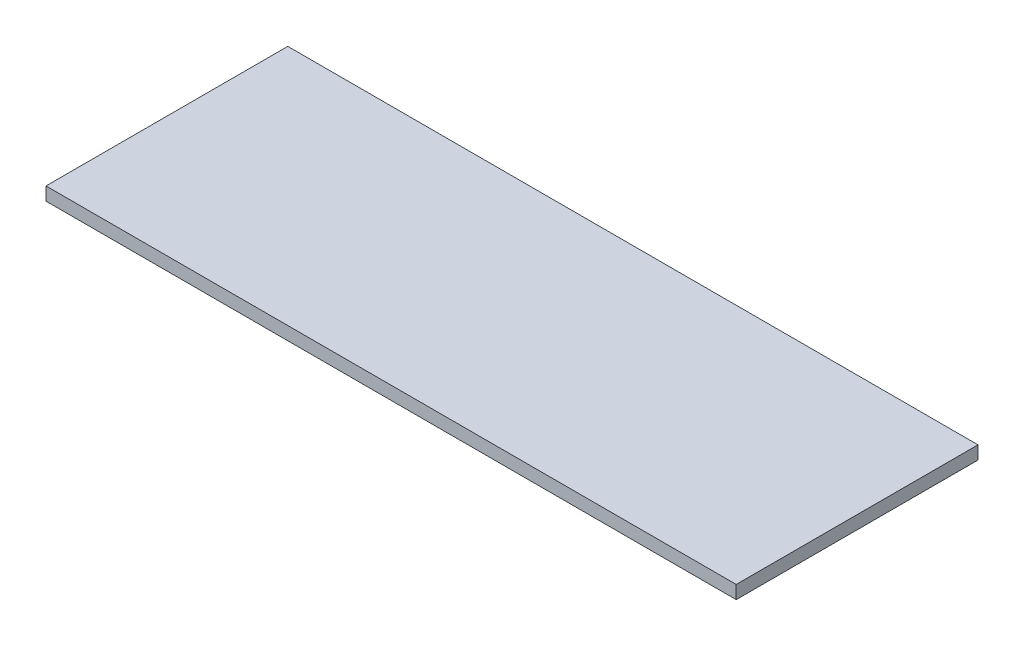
ISO-10303-21;
HEADER;
FILE_DESCRIPTION(('STEP AP214'),'2;1');
FILE_NAME('part.step','',(''),(''),'','','');
FILE_SCHEMA(('AUTOMOTIVE_DESIGN { 1 0 10303 214 1 1 1 1 }'));
ENDSEC;
DATA;
#1=APPLICATION_CONTEXT('core data for automotive mechanical design processes');
#2=APPLICATION_PROTOCOL_DEFINITION('international standard','automotive_design',2000,#1);
#3=PRODUCT_CONTEXT('',#1,'mechanical');
#4=PRODUCT('Part','Part','',(#3));
#5=PRODUCT_RELATED_PRODUCT_CATEGORY('part','',(#4));
#6=PRODUCT_DEFINITION_FORMATION('','',#4);
#7=PRODUCT_DEFINITION_CONTEXT('part definition',#1,'design');
#8=PRODUCT_DEFINITION('design','',#6,#7);
#9=PRODUCT_DEFINITION_SHAPE('','',#8);
#10=(LENGTH_UNIT() NAMED_UNIT(*) SI_UNIT(.MILLI.,.METRE.));
#11=(NAMED_UNIT(*) PLANE_ANGLE_UNIT() SI_UNIT($,.RADIAN.));
#12=(NAMED_UNIT(*) SI_UNIT($,.STERADIAN.) SOLID_ANGLE_UNIT());
#13=UNCERTAINTY_MEASURE_WITH_UNIT(LENGTH_MEASURE(1.E-05),#10,'distance_accuracy_value','');
#14=(GEOMETRIC_REPRESENTATION_CONTEXT(3) GLOBAL_UNCERTAINTY_ASSIGNED_CONTEXT((#13)) GLOBAL_UNIT_ASSIGNED_CONTEXT((#10,
#11,#12)) REPRESENTATION_CONTEXT('',''));
#15=CARTESIAN_POINT('',(0.,0.,0.));
#16=DIRECTION('',(0.,0.,1.));
#17=DIRECTION('',(1.,0.,0.));
#18=AXIS2_PLACEMENT_3D('',#15,#16,#17);
#19=CARTESIAN_POINT('',(-48.0292560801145,1.524,-10.1799856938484));
#20=DIRECTION('',(1.,0.,0.));
#21=DIRECTION('',(0.,0.,-1.));
#22=AXIS2_PLACEMENT_3D('',#19,#20,#21);
#23=PLANE('',#22);
#24=DIRECTION('',(0.,0.,1.));
#25=VECTOR('',#24,1.);
#26=CARTESIAN_POINT('',(-48.0292560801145,0.,-10.1799856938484));
#27=LINE('',#26,#25);
#28=CARTESIAN_POINT('',(-48.0292560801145,0.,-10.1799856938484));
#29=VERTEX_POINT('',#28);
#30=CARTESIAN_POINT('',(-48.0292560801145,0.,17.7600143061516));
#31=VERTEX_POINT('',#30);
#32=EDGE_CURVE('E75',#29,#31,#27,.T.);
#33=ORIENTED_EDGE('',*,*,#32,.T.);
#34=DIRECTION('',(0.,-1.,0.));
#35=VECTOR('',#34,1.);
#36=CARTESIAN_POINT('',(-48.0292560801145,1.524,17.7600143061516));
#37=LINE('',#36,#35);
#38=CARTESIAN_POINT('',(-48.0292560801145,1.524,17.7600143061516));
#39=VERTEX_POINT('',#38);
#40=EDGE_CURVE('E11',#39,#31,#37,.T.);
#41=ORIENTED_EDGE('',*,*,#40,.F.);
#42=DIRECTION('',(0.,0.,1.));
#43=VECTOR('',#42,1.);
#44=CARTESIAN_POINT('',(-48.0292560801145,1.524,-10.1799856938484));
#45=LINE('',#44,#43);
#46=CARTESIAN_POINT('',(-48.0292560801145,1.524,-10.1799856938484));
#47=VERTEX_POINT('',#46);
#48=EDGE_CURVE('E93',#47,#39,#45,.T.);
#49=ORIENTED_EDGE('',*,*,#48,.F.);
#50=DIRECTION('',(0.,-1.,0.));
#51=VECTOR('',#50,1.);
#52=CARTESIAN_POINT('',(-48.0292560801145,1.524,-10.1799856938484));
#53=LINE('',#52,#51);
#54=EDGE_CURVE('E87',#47,#29,#53,.T.);
#55=ORIENTED_EDGE('',*,*,#54,.T.);
#56=EDGE_LOOP('',(#33,#41,#49,#55));
#57=FACE_BOUND('',#56,.T.);
#58=ADVANCED_FACE('F31',(#57),#23,.F.);
#59=CARTESIAN_POINT('',(-48.0292560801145,1.524,17.7600143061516));
#60=DIRECTION('',(0.,0.,-1.));
#61=DIRECTION('',(-1.,0.,0.));
#62=AXIS2_PLACEMENT_3D('',#59,#60,#61);
#63=PLANE('',#62);
#64=DIRECTION('',(1.,0.,0.));
#65=VECTOR('',#64,1.);
#66=CARTESIAN_POINT('',(-48.0292560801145,0.,17.7600143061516));
#67=LINE('',#66,#65);
#68=CARTESIAN_POINT('',(31.7267439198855,0.,17.7600143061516));
#69=VERTEX_POINT('',#68);
#70=EDGE_CURVE('E71',#31,#69,#67,.T.);
#71=ORIENTED_EDGE('',*,*,#70,.T.);
#72=DIRECTION('',(0.,-1.,0.));
#73=VECTOR('',#72,1.);
#74=CARTESIAN_POINT('',(31.7267439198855,1.524,17.7600143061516));
#75=LINE('',#74,#73);
#76=CARTESIAN_POINT('',(31.7267439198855,1.524,17.7600143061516));
#77=VERTEX_POINT('',#76);
#78=EDGE_CURVE('E38',#77,#69,#75,.T.);
#79=ORIENTED_EDGE('',*,*,#78,.F.);
#80=DIRECTION('',(1.,0.,0.));
#81=VECTOR('',#80,1.);
#82=CARTESIAN_POINT('',(-48.0292560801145,1.524,17.7600143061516));
#83=LINE('',#82,#81);
#84=EDGE_CURVE('E83',#39,#77,#83,.T.);
#85=ORIENTED_EDGE('',*,*,#84,.F.);
#86=ORIENTED_EDGE('',*,*,#40,.T.);
#87=EDGE_LOOP('',(#71,#79,#85,#86));
#88=FACE_BOUND('',#87,.T.);
#89=ADVANCED_FACE('F82',(#88),#63,.F.);
#90=CARTESIAN_POINT('',(31.7267439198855,1.524,-10.1799856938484));
#91=DIRECTION('',(-1.,0.,0.));
#92=DIRECTION('',(0.,0.,1.));
#93=AXIS2_PLACEMENT_3D('',#90,#91,#92);
#94=PLANE('',#93);
#95=DIRECTION('',(0.,0.,-1.));
#96=VECTOR('',#95,1.);
#97=CARTESIAN_POINT('',(31.7267439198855,0.,-10.1799856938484));
#98=LINE('',#97,#96);
#99=CARTESIAN_POINT('',(31.7267439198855,0.,-10.1799856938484));
#100=VERTEX_POINT('',#99);
#101=EDGE_CURVE('E76',#69,#100,#98,.T.);
#102=ORIENTED_EDGE('',*,*,#101,.T.);
#103=DIRECTION('',(0.,-1.,0.));
#104=VECTOR('',#103,1.);
#105=CARTESIAN_POINT('',(31.7267439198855,1.524,-10.1799856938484));
#106=LINE('',#105,#104);
#107=CARTESIAN_POINT('',(31.7267439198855,1.524,-10.1799856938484));
#108=VERTEX_POINT('',#107);
#109=EDGE_CURVE('E99',#108,#100,#106,.T.);
#110=ORIENTED_EDGE('',*,*,#109,.F.);
#111=DIRECTION('',(0.,0.,-1.));
#112=VECTOR('',#111,1.);
#113=CARTESIAN_POINT('',(31.7267439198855,1.524,-10.1799856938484));
#114=LINE('',#113,#112);
#115=EDGE_CURVE('E50',#77,#108,#114,.T.);
#116=ORIENTED_EDGE('',*,*,#115,.F.);
#117=ORIENTED_EDGE('',*,*,#78,.T.);
#118=EDGE_LOOP('',(#102,#110,#116,#117));
#119=FACE_BOUND('',#118,.T.);
#120=ADVANCED_FACE('F102',(#119),#94,.F.);
#121=CARTESIAN_POINT('',(-48.0292560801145,1.524,-10.1799856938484));
#122=DIRECTION('',(0.,0.,1.));
#123=DIRECTION('',(1.,0.,0.));
#124=AXIS2_PLACEMENT_3D('',#121,#122,#123);
#125=PLANE('',#124);
#126=DIRECTION('',(-1.,0.,0.));
#127=VECTOR('',#126,1.);
#128=CARTESIAN_POINT('',(-48.0292560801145,0.,-10.1799856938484));
#129=LINE('',#128,#127);
#130=EDGE_CURVE('E91',#100,#29,#129,.T.);
#131=ORIENTED_EDGE('',*,*,#130,.T.);
#132=ORIENTED_EDGE('',*,*,#54,.F.);
#133=DIRECTION('',(-1.,0.,0.));
#134=VECTOR('',#133,1.);
#135=CARTESIAN_POINT('',(-48.0292560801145,1.524,-10.1799856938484));
#136=LINE('',#135,#134);
#137=EDGE_CURVE('E45',#108,#47,#136,.T.);
#138=ORIENTED_EDGE('',*,*,#137,.F.);
#139=ORIENTED_EDGE('',*,*,#109,.T.);
#140=EDGE_LOOP('',(#131,#132,#138,#139));
#141=FACE_BOUND('',#140,.T.);
#142=ADVANCED_FACE('F104',(#141),#125,.F.);
#143=CARTESIAN_POINT('',(-48.0292560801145,1.524,17.7600143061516));
#144=DIRECTION('',(0.,1.,0.));
#145=DIRECTION('',(0.,0.,1.));
#146=AXIS2_PLACEMENT_3D('',#143,#144,#145);
#147=PLANE('',#146);
#148=ORIENTED_EDGE('',*,*,#48,.T.);
#149=ORIENTED_EDGE('',*,*,#84,.T.);
#150=ORIENTED_EDGE('',*,*,#115,.T.);
#151=ORIENTED_EDGE('',*,*,#137,.T.);
#152=EDGE_LOOP('',(#148,#149,#150,#151));
#153=FACE_BOUND('',#152,.T.);
#154=ADVANCED_FACE('F105',(#153),#147,.T.);
#155=CARTESIAN_POINT('',(-48.0292560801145,0.,17.7600143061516));
#156=DIRECTION('',(0.,1.,0.));
#157=DIRECTION('',(0.,0.,1.));
#158=AXIS2_PLACEMENT_3D('',#155,#156,#157);
#159=PLANE('',#158);
#160=ORIENTED_EDGE('',*,*,#32,.F.);
#161=ORIENTED_EDGE('',*,*,#130,.F.);
#162=ORIENTED_EDGE('',*,*,#101,.F.);
#163=ORIENTED_EDGE('',*,*,#70,.F.);
#164=EDGE_LOOP('',(#160,#161,#162,#163));
#165=FACE_BOUND('',#164,.T.);
#166=ADVANCED_FACE('F72',(#165),#159,.F.);
#167=CLOSED_SHELL('',(#58,#89,#120,#142,#154,#166));
#168=MANIFOLD_SOLID_BREP('B2',#167);
#169=ADVANCED_BREP_SHAPE_REPRESENTATION('',(#18,#168),#14);
#170=SHAPE_DEFINITION_REPRESENTATION(#9,#169);
ENDSEC;
END-ISO-10303-21;
